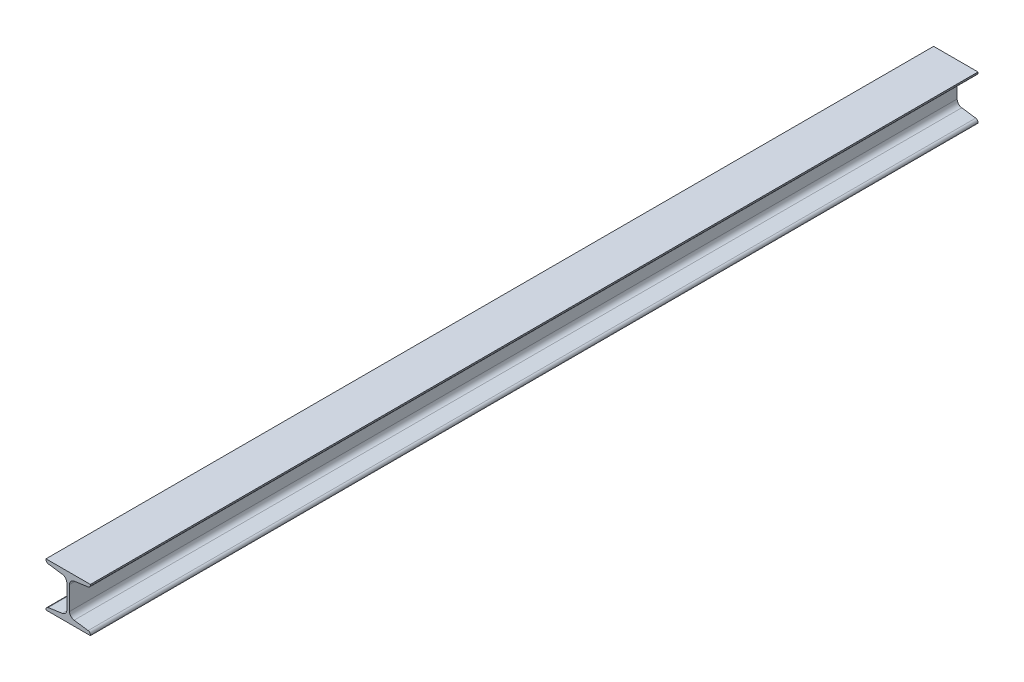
from build123d import *

# Parameters (mm, degrees)
EXTRUIR1_DEPTH = 2000


with BuildPart() as part:
    # Croquis1 → Extruir1 (new body)
    with BuildSketch(Plane.XY):
        with BuildLine():
            Line((51.713, 0), (51.713, 1.481569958))
            ThreePointArc((51.713, 1.481569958), (53.184742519, 5.417924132), (56.877961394, 7.42317837))
            Line((56.877961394, 7.42317837), (88.383077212, 11.850933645))
            ThreePointArc((88.383077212, 11.850933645), (95.769514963, 15.861442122), (98.713, 23.73415047))
            Line((98.713, 23.73415047), (98.713, 76.26584953))
            ThreePointArc((98.713, 76.26584953), (95.769514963, 84.138557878), (88.383077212, 88.149066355))
            Line((88.383077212, 88.149066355), (56.877961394, 92.57682163))
            ThreePointArc((56.877961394, 92.57682163), (53.184742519, 94.582075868), (51.713, 98.518430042))
            Line((51.713, 98.518430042), (51.713, 100))
            Line((51.713, 100), (151.713, 100))
            Line((151.713, 100), (151.713, 98.518430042))
            ThreePointArc((151.713, 98.518430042), (150.241257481, 94.582075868), (146.548038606, 92.57682163))
            Line((146.548038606, 92.57682163), (115.042922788, 88.149066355))
            ThreePointArc((115.042922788, 88.149066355), (107.656485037, 84.138557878), (104.713, 76.26584953))
            Line((104.713, 76.26584953), (104.713, 23.73415047))
            ThreePointArc((104.713, 23.73415047), (107.656485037, 15.861442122), (115.042922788, 11.850933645))
            Line((115.042922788, 11.850933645), (146.548038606, 7.42317837))
            ThreePointArc((146.548038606, 7.42317837), (150.241257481, 5.417924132), (151.713, 1.481569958))
            Line((151.713, 1.481569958), (151.713, 0))
            Line((151.713, 0), (51.713, 0))
        make_face()
    extrude(amount=EXTRUIR1_DEPTH)


solid = part.part
